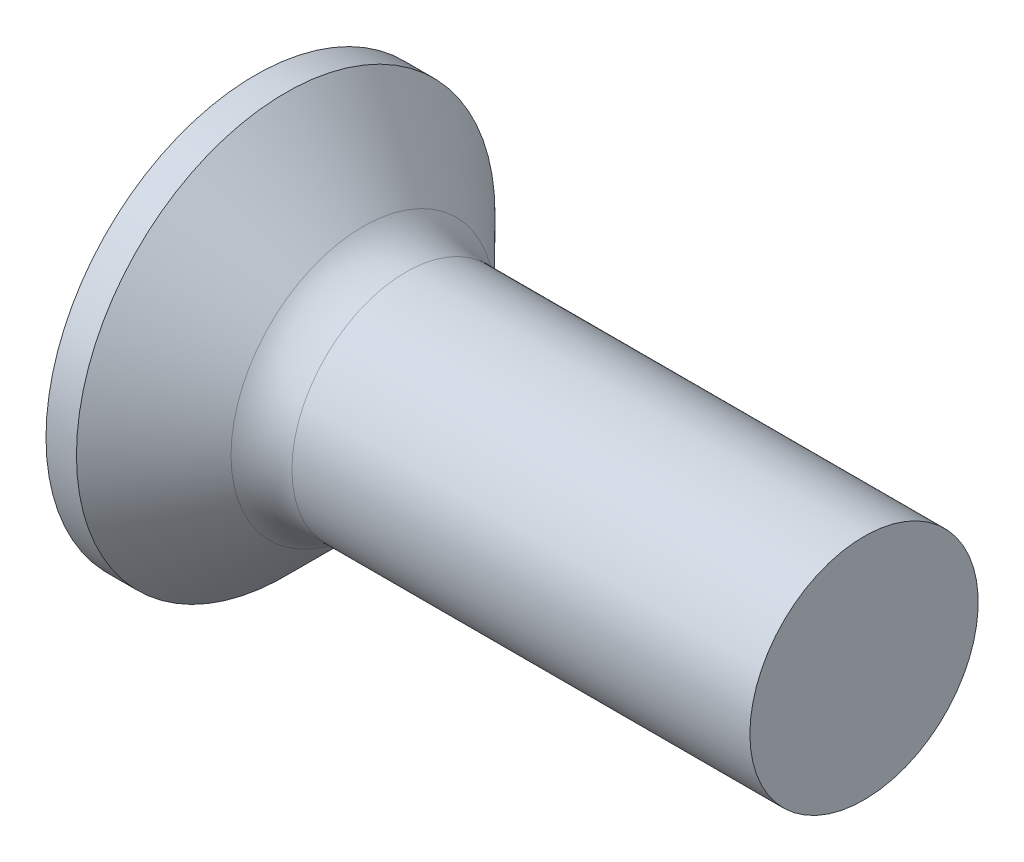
ISO-10303-21;
HEADER;
FILE_DESCRIPTION(('STEP AP214'),'2;1');
FILE_NAME('part.step','',(''),(''),'','','');
FILE_SCHEMA(('AUTOMOTIVE_DESIGN { 1 0 10303 214 1 1 1 1 }'));
ENDSEC;
DATA;
#1=APPLICATION_CONTEXT('core data for automotive mechanical design processes');
#2=APPLICATION_PROTOCOL_DEFINITION('international standard','automotive_design',2000,#1);
#3=PRODUCT_CONTEXT('',#1,'mechanical');
#4=PRODUCT('Part','Part','',(#3));
#5=PRODUCT_RELATED_PRODUCT_CATEGORY('part','',(#4));
#6=PRODUCT_DEFINITION_FORMATION('','',#4);
#7=PRODUCT_DEFINITION_CONTEXT('part definition',#1,'design');
#8=PRODUCT_DEFINITION('design','',#6,#7);
#9=PRODUCT_DEFINITION_SHAPE('','',#8);
#10=(LENGTH_UNIT() NAMED_UNIT(*) SI_UNIT(.MILLI.,.METRE.));
#11=(NAMED_UNIT(*) PLANE_ANGLE_UNIT() SI_UNIT($,.RADIAN.));
#12=(NAMED_UNIT(*) SI_UNIT($,.STERADIAN.) SOLID_ANGLE_UNIT());
#13=UNCERTAINTY_MEASURE_WITH_UNIT(LENGTH_MEASURE(1.E-05),#10,'distance_accuracy_value','');
#14=(GEOMETRIC_REPRESENTATION_CONTEXT(3) GLOBAL_UNCERTAINTY_ASSIGNED_CONTEXT((#13)) GLOBAL_UNIT_ASSIGNED_CONTEXT((#10,
#11,#12)) REPRESENTATION_CONTEXT('',''));
#15=CARTESIAN_POINT('',(0.,0.,0.));
#16=DIRECTION('',(0.,0.,1.));
#17=DIRECTION('',(1.,0.,0.));
#18=AXIS2_PLACEMENT_3D('',#15,#16,#17);
#19=CARTESIAN_POINT('',(0.,0.,0.));
#20=DIRECTION('',(-1.,0.,0.));
#21=DIRECTION('',(0.,0.,1.));
#22=AXIS2_PLACEMENT_3D('',#19,#20,#21);
#23=PLANE('',#22);
#24=CARTESIAN_POINT('',(0.,0.,0.));
#25=DIRECTION('',(-1.,0.,0.));
#26=DIRECTION('',(0.,0.,1.));
#27=AXIS2_PLACEMENT_3D('',#24,#25,#26);
#28=CIRCLE('',#27,2.75);
#29=CARTESIAN_POINT('',(0.,0.,2.75));
#30=VERTEX_POINT('',#29);
#31=EDGE_CURVE('E341',#30,#30,#28,.T.);
#32=ORIENTED_EDGE('',*,*,#31,.T.);
#33=EDGE_LOOP('',(#32));
#34=FACE_BOUND('',#33,.T.);
#35=DIRECTION('',(0.,0.,-1.));
#36=VECTOR('',#35,1.);
#37=CARTESIAN_POINT('',(0.,-0.370000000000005,1.5));
#38=LINE('',#37,#36);
#39=CARTESIAN_POINT('',(0.,-0.370000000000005,1.5));
#40=VERTEX_POINT('',#39);
#41=CARTESIAN_POINT('',(0.,-0.370000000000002,0.590157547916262));
#42=VERTEX_POINT('',#41);
#43=EDGE_CURVE('E380',#40,#42,#38,.T.);
#44=ORIENTED_EDGE('',*,*,#43,.T.);
#45=CARTESIAN_POINT('',(0.,0.,0.));
#46=DIRECTION('',(-1.,0.,0.));
#47=DIRECTION('',(0.,0.,1.));
#48=AXIS2_PLACEMENT_3D('',#45,#46,#47);
#49=CIRCLE('',#48,0.696552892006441);
#50=CARTESIAN_POINT('',(0.,-0.590157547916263,0.37));
#51=VERTEX_POINT('',#50);
#52=EDGE_CURVE('E367',#51,#42,#49,.T.);
#53=ORIENTED_EDGE('',*,*,#52,.F.);
#54=DIRECTION('',(0.,-1.,0.));
#55=VECTOR('',#54,1.);
#56=CARTESIAN_POINT('',(0.,1.5,0.37));
#57=LINE('',#56,#55);
#58=CARTESIAN_POINT('',(0.,-1.5,0.37));
#59=VERTEX_POINT('',#58);
#60=EDGE_CURVE('E427',#51,#59,#57,.T.);
#61=ORIENTED_EDGE('',*,*,#60,.T.);
#62=DIRECTION('',(0.,0.,-1.));
#63=VECTOR('',#62,1.);
#64=CARTESIAN_POINT('',(0.,-1.5,0.37));
#65=LINE('',#64,#63);
#66=CARTESIAN_POINT('',(0.,-1.5,-0.37));
#67=VERTEX_POINT('',#66);
#68=EDGE_CURVE('E338',#59,#67,#65,.T.);
#69=ORIENTED_EDGE('',*,*,#68,.T.);
#70=DIRECTION('',(0.,1.,0.));
#71=VECTOR('',#70,1.);
#72=CARTESIAN_POINT('',(0.,-1.5,-0.37));
#73=LINE('',#72,#71);
#74=CARTESIAN_POINT('',(0.,-0.590157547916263,-0.37));
#75=VERTEX_POINT('',#74);
#76=EDGE_CURVE('E428',#67,#75,#73,.T.);
#77=ORIENTED_EDGE('',*,*,#76,.T.);
#78=CARTESIAN_POINT('',(0.,-0.369999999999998,-0.590157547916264));
#79=VERTEX_POINT('',#78);
#80=EDGE_CURVE('E373',#79,#75,#49,.T.);
#81=ORIENTED_EDGE('',*,*,#80,.F.);
#82=CARTESIAN_POINT('',(0.,-0.369999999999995,-1.5));
#83=VERTEX_POINT('',#82);
#84=EDGE_CURVE('E389',#79,#83,#38,.T.);
#85=ORIENTED_EDGE('',*,*,#84,.T.);
#86=DIRECTION('',(0.,1.,0.));
#87=VECTOR('',#86,1.);
#88=CARTESIAN_POINT('',(0.,-0.369999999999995,-1.5));
#89=LINE('',#88,#87);
#90=CARTESIAN_POINT('',(0.,0.370000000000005,-1.5));
#91=VERTEX_POINT('',#90);
#92=EDGE_CURVE('E388',#83,#91,#89,.T.);
#93=ORIENTED_EDGE('',*,*,#92,.T.);
#94=DIRECTION('',(0.,0.,1.));
#95=VECTOR('',#94,1.);
#96=CARTESIAN_POINT('',(0.,0.370000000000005,-1.5));
#97=LINE('',#96,#95);
#98=CARTESIAN_POINT('',(0.,0.370000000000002,-0.590157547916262));
#99=VERTEX_POINT('',#98);
#100=EDGE_CURVE('E395',#91,#99,#97,.T.);
#101=ORIENTED_EDGE('',*,*,#100,.T.);
#102=CARTESIAN_POINT('',(0.,0.590157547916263,-0.37));
#103=VERTEX_POINT('',#102);
#104=EDGE_CURVE('E463',#103,#99,#49,.T.);
#105=ORIENTED_EDGE('',*,*,#104,.F.);
#106=CARTESIAN_POINT('',(0.,1.5,-0.37));
#107=VERTEX_POINT('',#106);
#108=EDGE_CURVE('E436',#103,#107,#73,.T.);
#109=ORIENTED_EDGE('',*,*,#108,.T.);
#110=DIRECTION('',(0.,0.,1.));
#111=VECTOR('',#110,1.);
#112=CARTESIAN_POINT('',(0.,1.5,-0.37));
#113=LINE('',#112,#111);
#114=CARTESIAN_POINT('',(0.,1.5,0.37));
#115=VERTEX_POINT('',#114);
#116=EDGE_CURVE('E424',#107,#115,#113,.T.);
#117=ORIENTED_EDGE('',*,*,#116,.T.);
#118=CARTESIAN_POINT('',(0.,0.590157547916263,0.37));
#119=VERTEX_POINT('',#118);
#120=EDGE_CURVE('E429',#115,#119,#57,.T.);
#121=ORIENTED_EDGE('',*,*,#120,.T.);
#122=CARTESIAN_POINT('',(0.,0.369999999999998,0.590157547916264));
#123=VERTEX_POINT('',#122);
#124=EDGE_CURVE('E375',#123,#119,#49,.T.);
#125=ORIENTED_EDGE('',*,*,#124,.F.);
#126=CARTESIAN_POINT('',(0.,0.369999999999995,1.5));
#127=VERTEX_POINT('',#126);
#128=EDGE_CURVE('E398',#123,#127,#97,.T.);
#129=ORIENTED_EDGE('',*,*,#128,.T.);
#130=DIRECTION('',(0.,-1.,0.));
#131=VECTOR('',#130,1.);
#132=CARTESIAN_POINT('',(0.,0.369999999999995,1.5));
#133=LINE('',#132,#131);
#134=EDGE_CURVE('E387',#127,#40,#133,.T.);
#135=ORIENTED_EDGE('',*,*,#134,.T.);
#136=EDGE_LOOP('',(#44,#53,#61,#69,#77,#81,#85,#93,#101,#105,#109,#117,#121,#125,#129,#135));
#137=FACE_BOUND('',#136,.T.);
#138=ADVANCED_FACE('F34',(#34,#137),#23,.T.);
#139=CARTESIAN_POINT('',(2.01,-0.49785100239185,0.37));
#140=DIRECTION('',(0.,0.,-1.));
#141=DIRECTION('',(0.,1.,0.));
#142=AXIS2_PLACEMENT_3D('',#139,#140,#141);
#143=PLANE('',#142);
#144=ORIENTED_EDGE('',*,*,#60,.F.);
#145=CARTESIAN_POINT('',(-1.01053649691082,-0.672102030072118,0.37));
#146=CARTESIAN_POINT('',(-0.79970605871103,-0.655267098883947,0.37));
#147=CARTESIAN_POINT('',(-0.588886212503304,-0.638297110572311,0.37));
#148=CARTESIAN_POINT('',(-0.167272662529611,-0.603984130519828,0.37));
#149=CARTESIAN_POINT('',(0.0435210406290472,-0.586641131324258,0.37));
#150=CARTESIAN_POINT('',(0.465068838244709,-0.551479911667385,0.37));
#151=CARTESIAN_POINT('',(0.67582293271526,-0.533661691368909,0.37));
#152=CARTESIAN_POINT('',(1.09727362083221,-0.497387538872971,0.37));
#153=CARTESIAN_POINT('',(1.30797021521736,-0.478931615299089,0.37));
#154=CARTESIAN_POINT('',(1.67418894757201,-0.446067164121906,0.37));
#155=CARTESIAN_POINT('',(1.82972932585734,-0.431862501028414,0.37));
#156=CARTESIAN_POINT('',(2.14074770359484,-0.40279770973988,0.37));
#157=CARTESIAN_POINT('',(2.29622570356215,-0.38793758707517,0.37));
#158=CARTESIAN_POINT('',(2.60710169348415,-0.357305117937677,0.37));
#159=CARTESIAN_POINT('',(2.76249967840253,-0.34153271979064,0.37));
#160=CARTESIAN_POINT('',(2.99549070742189,-0.316847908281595,0.37));
#161=CARTESIAN_POINT('',(3.07313791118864,-0.308448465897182,0.37));
#162=CARTESIAN_POINT('',(3.22838341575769,-0.29120225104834,0.37));
#163=CARTESIAN_POINT('',(3.30598171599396,-0.282355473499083,0.37));
#164=CARTESIAN_POINT('',(3.38354828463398,-0.273232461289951,0.37));
#165=B_SPLINE_CURVE_WITH_KNOTS('',3,(#145,#146,#147,#148,#149,#150,#151,#152,#153,#154,#155,
#156,#157,#158,#159,#160,#161,#162,#163,#164),.UNSPECIFIED.,.F.,.F.,(4,2,2,2,2,2,2,2,2,4),(0.,
0.634504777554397,1.26902224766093,1.90353950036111,2.53804817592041,3.00661008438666,
3.47516804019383,3.94375256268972,4.17805198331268,4.41235406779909),.UNSPECIFIED.);
#166=CARTESIAN_POINT('',(2.01,-0.415013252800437,0.37));
#167=VERTEX_POINT('',#166);
#168=EDGE_CURVE('E370',#51,#167,#165,.T.);
#169=ORIENTED_EDGE('',*,*,#168,.T.);
#170=DIRECTION('',(0.,-1.,0.));
#171=VECTOR('',#170,1.);
#172=CARTESIAN_POINT('',(2.01,0.497851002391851,0.37));
#173=LINE('',#172,#171);
#174=CARTESIAN_POINT('',(2.01,-0.497851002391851,0.37));
#175=VERTEX_POINT('',#174);
#176=EDGE_CURVE('E443',#167,#175,#173,.T.);
#177=ORIENTED_EDGE('',*,*,#176,.T.);
#178=DIRECTION('',(0.89493436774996,0.446197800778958,0.));
#179=VECTOR('',#178,1.);
#180=CARTESIAN_POINT('',(0.,-1.5,0.37));
#181=LINE('',#180,#179);
#182=EDGE_CURVE('E316',#59,#175,#181,.T.);
#183=ORIENTED_EDGE('',*,*,#182,.F.);
#184=EDGE_LOOP('',(#144,#169,#177,#183));
#185=FACE_BOUND('',#184,.T.);
#186=ADVANCED_FACE('F188',(#185),#143,.T.);
#187=CARTESIAN_POINT('',(2.01,0.497851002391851,0.37));
#188=VERTEX_POINT('',#187);
#189=CARTESIAN_POINT('',(2.01,0.415013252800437,0.37));
#190=VERTEX_POINT('',#189);
#191=EDGE_CURVE('E325',#188,#190,#173,.T.);
#192=ORIENTED_EDGE('',*,*,#191,.T.);
#193=CARTESIAN_POINT('',(-1.01053649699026,0.672102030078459,0.37));
#194=CARTESIAN_POINT('',(-0.799706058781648,0.65526709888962,0.37));
#195=CARTESIAN_POINT('',(-0.588886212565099,0.638297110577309,0.37));
#196=CARTESIAN_POINT('',(-0.167272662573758,0.603984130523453,0.37));
#197=CARTESIAN_POINT('',(0.043521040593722,0.586641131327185,0.37));
#198=CARTESIAN_POINT('',(0.465068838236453,0.551479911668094,0.37));
#199=CARTESIAN_POINT('',(0.675822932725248,0.533661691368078,0.37));
#200=CARTESIAN_POINT('',(1.09727362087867,0.497387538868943,0.37));
#201=CARTESIAN_POINT('',(1.30797021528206,0.478931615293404,0.37));
#202=CARTESIAN_POINT('',(1.67418894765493,0.446067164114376,0.37));
#203=CARTESIAN_POINT('',(1.82972932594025,0.431862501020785,0.37));
#204=CARTESIAN_POINT('',(2.14074770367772,0.402797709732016,0.37));
#205=CARTESIAN_POINT('',(2.29622570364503,0.38793758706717,0.37));
#206=CARTESIAN_POINT('',(2.60710169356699,0.357305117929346,0.37));
#207=CARTESIAN_POINT('',(2.76249967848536,0.341532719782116,0.37));
#208=CARTESIAN_POINT('',(2.99549070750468,0.316847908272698,0.37));
#209=CARTESIAN_POINT('',(3.07313791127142,0.308448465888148,0.37));
#210=CARTESIAN_POINT('',(3.22838341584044,0.291202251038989,0.37));
#211=CARTESIAN_POINT('',(3.30598171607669,0.282355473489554,0.37));
#212=CARTESIAN_POINT('',(3.38354828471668,0.273232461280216,0.37));
#213=B_SPLINE_CURVE_WITH_KNOTS('',3,(#193,#194,#195,#196,#197,#198,#199,#200,#201,#202,#203,
#204,#205,#206,#207,#208,#209,#210,#211,#212),.UNSPECIFIED.,.F.,.F.,(4,2,2,2,2,2,2,2,2,4),(0.,
0.634504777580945,1.26902224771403,1.90353950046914,2.53804817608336,3.00661008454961,
3.47516804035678,3.94375256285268,4.17805198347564,4.41235406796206),.UNSPECIFIED.);
#214=EDGE_CURVE('E248',#190,#119,#213,.F.);
#215=ORIENTED_EDGE('',*,*,#214,.T.);
#216=ORIENTED_EDGE('',*,*,#120,.F.);
#217=DIRECTION('',(0.89493436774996,-0.446197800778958,0.));
#218=VECTOR('',#217,1.);
#219=CARTESIAN_POINT('',(0.,1.5,0.37));
#220=LINE('',#219,#218);
#221=EDGE_CURVE('E57',#115,#188,#220,.T.);
#222=ORIENTED_EDGE('',*,*,#221,.T.);
#223=EDGE_LOOP('',(#192,#215,#216,#222));
#224=FACE_BOUND('',#223,.T.);
#225=ADVANCED_FACE('F193',(#224),#143,.T.);
#226=CARTESIAN_POINT('',(2.01,0.497851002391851,-0.37));
#227=DIRECTION('',(0.,0.,1.));
#228=DIRECTION('',(1.,0.,0.));
#229=AXIS2_PLACEMENT_3D('',#226,#227,#228);
#230=PLANE('',#229);
#231=DIRECTION('',(0.,1.,0.));
#232=VECTOR('',#231,1.);
#233=CARTESIAN_POINT('',(2.01,-0.497851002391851,-0.37));
#234=LINE('',#233,#232);
#235=CARTESIAN_POINT('',(2.01,-0.497851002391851,-0.37));
#236=VERTEX_POINT('',#235);
#237=CARTESIAN_POINT('',(2.01,-0.415013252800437,-0.37));
#238=VERTEX_POINT('',#237);
#239=EDGE_CURVE('E329',#236,#238,#234,.T.);
#240=ORIENTED_EDGE('',*,*,#239,.T.);
#241=CARTESIAN_POINT('',(-1.01053649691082,-0.672102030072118,-0.37));
#242=CARTESIAN_POINT('',(-0.79970605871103,-0.655267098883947,-0.37));
#243=CARTESIAN_POINT('',(-0.588886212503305,-0.638297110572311,-0.37));
#244=CARTESIAN_POINT('',(-0.16727266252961,-0.603984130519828,-0.37));
#245=CARTESIAN_POINT('',(0.0435210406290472,-0.586641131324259,-0.37));
#246=CARTESIAN_POINT('',(0.465068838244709,-0.551479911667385,-0.37));
#247=CARTESIAN_POINT('',(0.67582293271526,-0.533661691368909,-0.37));
#248=CARTESIAN_POINT('',(1.09727362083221,-0.497387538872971,-0.37));
#249=CARTESIAN_POINT('',(1.30797021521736,-0.47893161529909,-0.37));
#250=CARTESIAN_POINT('',(1.67418894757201,-0.446067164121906,-0.37));
#251=CARTESIAN_POINT('',(1.82972932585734,-0.431862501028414,-0.37));
#252=CARTESIAN_POINT('',(2.14074770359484,-0.40279770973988,-0.37));
#253=CARTESIAN_POINT('',(2.29622570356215,-0.38793758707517,-0.37));
#254=CARTESIAN_POINT('',(2.60710169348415,-0.357305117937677,-0.37));
#255=CARTESIAN_POINT('',(2.76249967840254,-0.34153271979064,-0.37));
#256=CARTESIAN_POINT('',(2.99549070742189,-0.316847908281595,-0.37));
#257=CARTESIAN_POINT('',(3.07313791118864,-0.308448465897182,-0.37));
#258=CARTESIAN_POINT('',(3.22838341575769,-0.29120225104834,-0.37));
#259=CARTESIAN_POINT('',(3.30598171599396,-0.282355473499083,-0.37));
#260=CARTESIAN_POINT('',(3.38354828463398,-0.273232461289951,-0.37));
#261=B_SPLINE_CURVE_WITH_KNOTS('',3,(#241,#242,#243,#244,#245,#246,#247,#248,#249,#250,#251,
#252,#253,#254,#255,#256,#257,#258,#259,#260),.UNSPECIFIED.,.F.,.F.,(4,2,2,2,2,2,2,2,2,4),(0.,
0.634504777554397,1.26902224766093,1.90353950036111,2.53804817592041,3.00661008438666,
3.47516804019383,3.94375256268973,4.17805198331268,4.41235406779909),.UNSPECIFIED.);
#262=EDGE_CURVE('E242',#238,#75,#261,.F.);
#263=ORIENTED_EDGE('',*,*,#262,.T.);
#264=ORIENTED_EDGE('',*,*,#76,.F.);
#265=DIRECTION('',(0.89493436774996,0.446197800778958,0.));
#266=VECTOR('',#265,1.);
#267=CARTESIAN_POINT('',(0.,-1.5,-0.37));
#268=LINE('',#267,#266);
#269=EDGE_CURVE('E438',#67,#236,#268,.T.);
#270=ORIENTED_EDGE('',*,*,#269,.T.);
#271=EDGE_LOOP('',(#240,#263,#264,#270));
#272=FACE_BOUND('',#271,.T.);
#273=ADVANCED_FACE('F228',(#272),#230,.T.);
#274=ORIENTED_EDGE('',*,*,#108,.F.);
#275=CARTESIAN_POINT('',(-1.01053649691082,0.672102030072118,-0.37));
#276=CARTESIAN_POINT('',(-0.79970605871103,0.655267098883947,-0.37));
#277=CARTESIAN_POINT('',(-0.588886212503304,0.638297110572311,-0.37));
#278=CARTESIAN_POINT('',(-0.16727266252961,0.603984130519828,-0.37));
#279=CARTESIAN_POINT('',(0.0435210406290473,0.586641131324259,-0.37));
#280=CARTESIAN_POINT('',(0.465068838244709,0.551479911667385,-0.37));
#281=CARTESIAN_POINT('',(0.67582293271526,0.533661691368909,-0.37));
#282=CARTESIAN_POINT('',(1.09727362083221,0.497387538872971,-0.37));
#283=CARTESIAN_POINT('',(1.30797021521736,0.478931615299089,-0.37));
#284=CARTESIAN_POINT('',(1.67418894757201,0.446067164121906,-0.37));
#285=CARTESIAN_POINT('',(1.82972932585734,0.431862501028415,-0.37));
#286=CARTESIAN_POINT('',(2.14074770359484,0.40279770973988,-0.37));
#287=CARTESIAN_POINT('',(2.29622570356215,0.38793758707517,-0.37));
#288=CARTESIAN_POINT('',(2.60710169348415,0.357305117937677,-0.37));
#289=CARTESIAN_POINT('',(2.76249967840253,0.34153271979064,-0.37));
#290=CARTESIAN_POINT('',(2.99549070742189,0.316847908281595,-0.37));
#291=CARTESIAN_POINT('',(3.07313791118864,0.308448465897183,-0.37));
#292=CARTESIAN_POINT('',(3.22838341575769,0.29120225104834,-0.37));
#293=CARTESIAN_POINT('',(3.30598171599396,0.282355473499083,-0.37));
#294=CARTESIAN_POINT('',(3.38354828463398,0.273232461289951,-0.37));
#295=B_SPLINE_CURVE_WITH_KNOTS('',3,(#275,#276,#277,#278,#279,#280,#281,#282,#283,#284,#285,
#286,#287,#288,#289,#290,#291,#292,#293,#294),.UNSPECIFIED.,.F.,.F.,(4,2,2,2,2,2,2,2,2,4),(0.,
0.634504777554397,1.26902224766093,1.90353950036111,2.53804817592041,3.00661008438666,
3.47516804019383,3.94375256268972,4.17805198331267,4.41235406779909),.UNSPECIFIED.);
#296=CARTESIAN_POINT('',(2.01,0.415013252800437,-0.37));
#297=VERTEX_POINT('',#296);
#298=EDGE_CURVE('E236',#103,#297,#295,.T.);
#299=ORIENTED_EDGE('',*,*,#298,.T.);
#300=CARTESIAN_POINT('',(2.01,0.497851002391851,-0.37));
#301=VERTEX_POINT('',#300);
#302=EDGE_CURVE('E333',#297,#301,#234,.T.);
#303=ORIENTED_EDGE('',*,*,#302,.T.);
#304=DIRECTION('',(0.89493436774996,-0.446197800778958,0.));
#305=VECTOR('',#304,1.);
#306=CARTESIAN_POINT('',(0.,1.5,-0.37));
#307=LINE('',#306,#305);
#308=EDGE_CURVE('E320',#107,#301,#307,.T.);
#309=ORIENTED_EDGE('',*,*,#308,.F.);
#310=EDGE_LOOP('',(#274,#299,#303,#309));
#311=FACE_BOUND('',#310,.T.);
#312=ADVANCED_FACE('F220',(#311),#230,.T.);
#313=CARTESIAN_POINT('',(2.01,0.497851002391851,-0.37));
#314=DIRECTION('',(1.,0.,0.));
#315=DIRECTION('',(0.,0.,-1.));
#316=AXIS2_PLACEMENT_3D('',#313,#314,#315);
#317=PLANE('',#316);
#318=CARTESIAN_POINT('',(2.01,0.,0.));
#319=DIRECTION('',(-1.,0.,0.));
#320=DIRECTION('',(0.,0.,1.));
#321=AXIS2_PLACEMENT_3D('',#318,#319,#320);
#322=CIRCLE('',#321,0.555999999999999);
#323=CARTESIAN_POINT('',(2.01,-0.247548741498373,-0.497851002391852));
#324=VERTEX_POINT('',#323);
#325=CARTESIAN_POINT('',(2.01,-0.369999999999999,-0.415013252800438));
#326=VERTEX_POINT('',#325);
#327=EDGE_CURVE('E510',#324,#326,#322,.T.);
#328=ORIENTED_EDGE('',*,*,#327,.F.);
#329=DIRECTION('',(0.,1.,0.));
#330=VECTOR('',#329,1.);
#331=CARTESIAN_POINT('',(2.01,-0.369999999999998,-0.497851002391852));
#332=LINE('',#331,#330);
#333=CARTESIAN_POINT('',(2.01,-0.369999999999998,-0.497851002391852));
#334=VERTEX_POINT('',#333);
#335=EDGE_CURVE('E410',#334,#324,#332,.T.);
#336=ORIENTED_EDGE('',*,*,#335,.F.);
#337=DIRECTION('',(0.,0.,-1.));
#338=VECTOR('',#337,1.);
#339=CARTESIAN_POINT('',(2.01,-0.370000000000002,0.497851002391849));
#340=LINE('',#339,#338);
#341=EDGE_CURVE('E414',#326,#334,#340,.T.);
#342=ORIENTED_EDGE('',*,*,#341,.F.);
#343=EDGE_LOOP('',(#328,#336,#342));
#344=FACE_BOUND('',#343,.T.);
#345=ADVANCED_FACE('F216',(#344),#317,.F.);
#346=CARTESIAN_POINT('',(2.01,-0.497851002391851,-0.247548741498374));
#347=VERTEX_POINT('',#346);
#348=EDGE_CURVE('E481',#238,#347,#322,.T.);
#349=ORIENTED_EDGE('',*,*,#348,.F.);
#350=ORIENTED_EDGE('',*,*,#239,.F.);
#351=DIRECTION('',(0.,0.,-1.));
#352=VECTOR('',#351,1.);
#353=CARTESIAN_POINT('',(2.01,-0.497851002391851,0.37));
#354=LINE('',#353,#352);
#355=EDGE_CURVE('E321',#347,#236,#354,.T.);
#356=ORIENTED_EDGE('',*,*,#355,.F.);
#357=EDGE_LOOP('',(#349,#350,#356));
#358=FACE_BOUND('',#357,.T.);
#359=ADVANCED_FACE('F219',(#358),#317,.F.);
#360=CARTESIAN_POINT('',(2.01,-0.497851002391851,0.247548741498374));
#361=VERTEX_POINT('',#360);
#362=EDGE_CURVE('E477',#361,#167,#322,.T.);
#363=ORIENTED_EDGE('',*,*,#362,.F.);
#364=EDGE_CURVE('E311',#175,#361,#354,.T.);
#365=ORIENTED_EDGE('',*,*,#364,.F.);
#366=ORIENTED_EDGE('',*,*,#176,.F.);
#367=EDGE_LOOP('',(#363,#365,#366));
#368=FACE_BOUND('',#367,.T.);
#369=ADVANCED_FACE('F475',(#368),#317,.F.);
#370=CARTESIAN_POINT('',(2.01,-0.370000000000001,0.415013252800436));
#371=VERTEX_POINT('',#370);
#372=CARTESIAN_POINT('',(2.01,-0.247548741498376,0.49785100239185));
#373=VERTEX_POINT('',#372);
#374=EDGE_CURVE('E49',#371,#373,#322,.T.);
#375=ORIENTED_EDGE('',*,*,#374,.F.);
#376=CARTESIAN_POINT('',(2.01,-0.370000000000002,0.497851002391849));
#377=VERTEX_POINT('',#376);
#378=EDGE_CURVE('E383',#377,#371,#340,.T.);
#379=ORIENTED_EDGE('',*,*,#378,.F.);
#380=DIRECTION('',(0.,-1.,0.));
#381=VECTOR('',#380,1.);
#382=CARTESIAN_POINT('',(2.01,0.369999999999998,0.497851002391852));
#383=LINE('',#382,#381);
#384=EDGE_CURVE('E415',#373,#377,#383,.T.);
#385=ORIENTED_EDGE('',*,*,#384,.F.);
#386=EDGE_LOOP('',(#375,#379,#385));
#387=FACE_BOUND('',#386,.T.);
#388=ADVANCED_FACE('F521',(#387),#317,.F.);
#389=CARTESIAN_POINT('',(2.01,0.247548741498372,0.497851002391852));
#390=VERTEX_POINT('',#389);
#391=CARTESIAN_POINT('',(2.01,0.369999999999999,0.415013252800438));
#392=VERTEX_POINT('',#391);
#393=EDGE_CURVE('E374',#390,#392,#322,.T.);
#394=ORIENTED_EDGE('',*,*,#393,.F.);
#395=CARTESIAN_POINT('',(2.01,0.369999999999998,0.497851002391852));
#396=VERTEX_POINT('',#395);
#397=EDGE_CURVE('E411',#396,#390,#383,.T.);
#398=ORIENTED_EDGE('',*,*,#397,.F.);
#399=DIRECTION('',(0.,0.,1.));
#400=VECTOR('',#399,1.);
#401=CARTESIAN_POINT('',(2.01,0.370000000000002,-0.49785100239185));
#402=LINE('',#401,#400);
#403=EDGE_CURVE('E423',#392,#396,#402,.T.);
#404=ORIENTED_EDGE('',*,*,#403,.F.);
#405=EDGE_LOOP('',(#394,#398,#404));
#406=FACE_BOUND('',#405,.T.);
#407=ADVANCED_FACE('F486',(#406),#317,.F.);
#408=CARTESIAN_POINT('',(2.01,0.497851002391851,0.247548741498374));
#409=VERTEX_POINT('',#408);
#410=EDGE_CURVE('E455',#190,#409,#322,.T.);
#411=ORIENTED_EDGE('',*,*,#410,.F.);
#412=ORIENTED_EDGE('',*,*,#191,.F.);
#413=DIRECTION('',(0.,0.,1.));
#414=VECTOR('',#413,1.);
#415=CARTESIAN_POINT('',(2.01,0.497851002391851,-0.37));
#416=LINE('',#415,#414);
#417=EDGE_CURVE('E332',#409,#188,#416,.T.);
#418=ORIENTED_EDGE('',*,*,#417,.F.);
#419=EDGE_LOOP('',(#411,#412,#418));
#420=FACE_BOUND('',#419,.T.);
#421=ADVANCED_FACE('F453',(#420),#317,.F.);
#422=CARTESIAN_POINT('',(2.01,0.497851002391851,-0.247548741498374));
#423=VERTEX_POINT('',#422);
#424=EDGE_CURVE('E461',#423,#297,#322,.T.);
#425=ORIENTED_EDGE('',*,*,#424,.F.);
#426=EDGE_CURVE('E441',#301,#423,#416,.T.);
#427=ORIENTED_EDGE('',*,*,#426,.F.);
#428=ORIENTED_EDGE('',*,*,#302,.F.);
#429=EDGE_LOOP('',(#425,#427,#428));
#430=FACE_BOUND('',#429,.T.);
#431=ADVANCED_FACE('F305',(#430),#317,.F.);
#432=CARTESIAN_POINT('',(2.01,0.370000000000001,-0.415013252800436));
#433=VERTEX_POINT('',#432);
#434=CARTESIAN_POINT('',(2.01,0.247548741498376,-0.49785100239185));
#435=VERTEX_POINT('',#434);
#436=EDGE_CURVE('E504',#433,#435,#322,.T.);
#437=ORIENTED_EDGE('',*,*,#436,.F.);
#438=CARTESIAN_POINT('',(2.01,0.370000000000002,-0.49785100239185));
#439=VERTEX_POINT('',#438);
#440=EDGE_CURVE('E420',#439,#433,#402,.T.);
#441=ORIENTED_EDGE('',*,*,#440,.F.);
#442=EDGE_CURVE('E417',#435,#439,#332,.T.);
#443=ORIENTED_EDGE('',*,*,#442,.F.);
#444=EDGE_LOOP('',(#437,#441,#443));
#445=FACE_BOUND('',#444,.T.);
#446=ADVANCED_FACE('F222',(#445),#317,.F.);
#447=CARTESIAN_POINT('',(2.01,-0.497851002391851,-0.37));
#448=DIRECTION('',(-0.446197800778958,0.89493436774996,0.));
#449=DIRECTION('',(-0.89493436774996,-0.446197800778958,0.));
#450=AXIS2_PLACEMENT_3D('',#447,#448,#449);
#451=PLANE('',#450);
#452=ORIENTED_EDGE('',*,*,#364,.T.);
#453=CARTESIAN_POINT('',(2.86902882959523,-0.0695550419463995,0.));
#454=DIRECTION('',(-0.446197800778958,0.89493436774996,0.));
#455=DIRECTION('',(-0.89493436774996,-0.446197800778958,0.));
#456=AXIS2_PLACEMENT_3D('',#453,#454,#455);
#457=ELLIPSE('',#456,1.11145965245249,0.491029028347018);
#458=EDGE_CURVE('E312',#361,#347,#457,.F.);
#459=ORIENTED_EDGE('',*,*,#458,.T.);
#460=ORIENTED_EDGE('',*,*,#355,.T.);
#461=ORIENTED_EDGE('',*,*,#269,.F.);
#462=ORIENTED_EDGE('',*,*,#68,.F.);
#463=ORIENTED_EDGE('',*,*,#182,.T.);
#464=EDGE_LOOP('',(#452,#459,#460,#461,#462,#463));
#465=FACE_BOUND('',#464,.T.);
#466=ADVANCED_FACE('F227',(#465),#451,.T.);
#467=CARTESIAN_POINT('',(2.01,0.497851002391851,0.37));
#468=DIRECTION('',(-0.446197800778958,-0.89493436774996,0.));
#469=DIRECTION('',(0.89493436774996,-0.446197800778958,0.));
#470=AXIS2_PLACEMENT_3D('',#467,#468,#469);
#471=PLANE('',#470);
#472=ORIENTED_EDGE('',*,*,#426,.T.);
#473=CARTESIAN_POINT('',(2.86902882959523,0.0695550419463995,0.));
#474=DIRECTION('',(-0.446197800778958,-0.89493436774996,0.));
#475=DIRECTION('',(-0.89493436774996,0.446197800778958,0.));
#476=AXIS2_PLACEMENT_3D('',#473,#474,#475);
#477=ELLIPSE('',#476,1.11145965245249,0.491029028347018);
#478=EDGE_CURVE('E289',#423,#409,#477,.F.);
#479=ORIENTED_EDGE('',*,*,#478,.T.);
#480=ORIENTED_EDGE('',*,*,#417,.T.);
#481=ORIENTED_EDGE('',*,*,#221,.F.);
#482=ORIENTED_EDGE('',*,*,#116,.F.);
#483=ORIENTED_EDGE('',*,*,#308,.T.);
#484=EDGE_LOOP('',(#472,#479,#480,#481,#482,#483));
#485=FACE_BOUND('',#484,.T.);
#486=ADVANCED_FACE('F223',(#485),#471,.T.);
#487=CARTESIAN_POINT('',(2.01,0.369999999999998,0.497851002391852));
#488=DIRECTION('',(0.,-1.,0.));
#489=DIRECTION('',(1.,0.,0.));
#490=AXIS2_PLACEMENT_3D('',#487,#488,#489);
#491=PLANE('',#490);
#492=ORIENTED_EDGE('',*,*,#440,.T.);
#493=CARTESIAN_POINT('',(-1.01053649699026,0.370000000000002,-0.672102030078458));
#494=CARTESIAN_POINT('',(-0.799706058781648,0.370000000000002,-0.655267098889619));
#495=CARTESIAN_POINT('',(-0.588886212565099,0.370000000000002,-0.638297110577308));
#496=CARTESIAN_POINT('',(-0.167272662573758,0.370000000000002,-0.603984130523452));
#497=CARTESIAN_POINT('',(0.0435210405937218,0.370000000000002,-0.586641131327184));
#498=CARTESIAN_POINT('',(0.465068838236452,0.370000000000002,-0.551479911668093));
#499=CARTESIAN_POINT('',(0.675822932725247,0.370000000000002,-0.533661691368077));
#500=CARTESIAN_POINT('',(1.09727362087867,0.370000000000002,-0.497387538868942));
#501=CARTESIAN_POINT('',(1.30797021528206,0.370000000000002,-0.478931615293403));
#502=CARTESIAN_POINT('',(1.67418894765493,0.370000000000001,-0.446067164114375));
#503=CARTESIAN_POINT('',(1.82972932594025,0.370000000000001,-0.431862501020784));
#504=CARTESIAN_POINT('',(2.14074770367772,0.370000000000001,-0.402797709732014));
#505=CARTESIAN_POINT('',(2.29622570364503,0.370000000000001,-0.387937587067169));
#506=CARTESIAN_POINT('',(2.60710169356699,0.370000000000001,-0.357305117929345));
#507=CARTESIAN_POINT('',(2.76249967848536,0.370000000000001,-0.341532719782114));
#508=CARTESIAN_POINT('',(2.99549070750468,0.370000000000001,-0.316847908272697));
#509=CARTESIAN_POINT('',(3.07313791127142,0.370000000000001,-0.308448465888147));
#510=CARTESIAN_POINT('',(3.22838341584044,0.370000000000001,-0.291202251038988));
#511=CARTESIAN_POINT('',(3.30598171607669,0.370000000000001,-0.282355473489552));
#512=CARTESIAN_POINT('',(3.38354828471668,0.370000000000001,-0.273232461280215));
#513=B_SPLINE_CURVE_WITH_KNOTS('',3,(#493,#494,#495,#496,#497,#498,#499,#500,#501,#502,#503,
#504,#505,#506,#507,#508,#509,#510,#511,#512),.UNSPECIFIED.,.F.,.F.,(4,2,2,2,2,2,2,2,2,4),(0.,
0.634504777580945,1.26902224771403,1.90353950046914,2.53804817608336,3.00661008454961,
3.47516804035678,3.94375256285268,4.17805198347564,4.41235406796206),.UNSPECIFIED.);
#514=EDGE_CURVE('E282',#433,#99,#513,.F.);
#515=ORIENTED_EDGE('',*,*,#514,.T.);
#516=ORIENTED_EDGE('',*,*,#100,.F.);
#517=DIRECTION('',(0.89493436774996,0.,0.446197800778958));
#518=VECTOR('',#517,1.);
#519=CARTESIAN_POINT('',(0.,0.370000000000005,-1.5));
#520=LINE('',#519,#518);
#521=EDGE_CURVE('E402',#91,#439,#520,.T.);
#522=ORIENTED_EDGE('',*,*,#521,.T.);
#523=EDGE_LOOP('',(#492,#515,#516,#522));
#524=FACE_BOUND('',#523,.T.);
#525=ADVANCED_FACE('F226',(#524),#491,.T.);
#526=CARTESIAN_POINT('',(2.01,-0.369999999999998,-0.497851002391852));
#527=DIRECTION('',(0.,1.,0.));
#528=DIRECTION('',(0.,0.,1.));
#529=AXIS2_PLACEMENT_3D('',#526,#527,#528);
#530=PLANE('',#529);
#531=ORIENTED_EDGE('',*,*,#84,.F.);
#532=CARTESIAN_POINT('',(-1.01053649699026,-0.369999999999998,-0.67210203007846));
#533=CARTESIAN_POINT('',(-0.799706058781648,-0.369999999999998,-0.655267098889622));
#534=CARTESIAN_POINT('',(-0.588886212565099,-0.369999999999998,-0.638297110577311));
#535=CARTESIAN_POINT('',(-0.167272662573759,-0.369999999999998,-0.603984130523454));
#536=CARTESIAN_POINT('',(0.0435210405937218,-0.369999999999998,-0.586641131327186));
#537=CARTESIAN_POINT('',(0.465068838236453,-0.369999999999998,-0.551479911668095));
#538=CARTESIAN_POINT('',(0.675822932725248,-0.369999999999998,-0.53366169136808));
#539=CARTESIAN_POINT('',(1.09727362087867,-0.369999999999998,-0.497387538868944));
#540=CARTESIAN_POINT('',(1.30797021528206,-0.369999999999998,-0.478931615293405));
#541=CARTESIAN_POINT('',(1.67418894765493,-0.369999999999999,-0.446067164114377));
#542=CARTESIAN_POINT('',(1.82972932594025,-0.369999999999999,-0.431862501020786));
#543=CARTESIAN_POINT('',(2.14074770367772,-0.369999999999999,-0.402797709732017));
#544=CARTESIAN_POINT('',(2.29622570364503,-0.369999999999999,-0.387937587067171));
#545=CARTESIAN_POINT('',(2.60710169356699,-0.369999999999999,-0.357305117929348));
#546=CARTESIAN_POINT('',(2.76249967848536,-0.369999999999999,-0.341532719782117));
#547=CARTESIAN_POINT('',(2.99549070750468,-0.369999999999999,-0.316847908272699));
#548=CARTESIAN_POINT('',(3.07313791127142,-0.369999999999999,-0.30844846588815));
#549=CARTESIAN_POINT('',(3.22838341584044,-0.369999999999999,-0.291202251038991));
#550=CARTESIAN_POINT('',(3.30598171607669,-0.369999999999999,-0.282355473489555));
#551=CARTESIAN_POINT('',(3.38354828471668,-0.369999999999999,-0.273232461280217));
#552=B_SPLINE_CURVE_WITH_KNOTS('',3,(#532,#533,#534,#535,#536,#537,#538,#539,#540,#541,#542,
#543,#544,#545,#546,#547,#548,#549,#550,#551),.UNSPECIFIED.,.F.,.F.,(4,2,2,2,2,2,2,2,2,4),(0.,
0.634504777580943,1.26902224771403,1.90353950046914,2.53804817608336,3.00661008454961,
3.47516804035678,3.94375256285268,4.17805198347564,4.41235406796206),.UNSPECIFIED.);
#553=EDGE_CURVE('E276',#79,#326,#552,.T.);
#554=ORIENTED_EDGE('',*,*,#553,.T.);
#555=ORIENTED_EDGE('',*,*,#341,.T.);
#556=DIRECTION('',(0.89493436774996,0.,0.446197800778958));
#557=VECTOR('',#556,1.);
#558=CARTESIAN_POINT('',(0.,-0.369999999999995,-1.5));
#559=LINE('',#558,#557);
#560=EDGE_CURVE('E399',#83,#334,#559,.T.);
#561=ORIENTED_EDGE('',*,*,#560,.F.);
#562=EDGE_LOOP('',(#531,#554,#555,#561));
#563=FACE_BOUND('',#562,.T.);
#564=ADVANCED_FACE('F293',(#563),#530,.T.);
#565=CARTESIAN_POINT('',(2.01,0.370000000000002,-0.49785100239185));
#566=DIRECTION('',(-0.446197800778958,0.,0.89493436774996));
#567=DIRECTION('',(-0.89493436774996,0.,-0.446197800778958));
#568=AXIS2_PLACEMENT_3D('',#565,#566,#567);
#569=PLANE('',#568);
#570=ORIENTED_EDGE('',*,*,#335,.T.);
#571=CARTESIAN_POINT('',(2.86902882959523,0.,-0.0695550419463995));
#572=DIRECTION('',(-0.446197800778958,0.,0.89493436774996));
#573=DIRECTION('',(-0.89493436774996,0.,-0.446197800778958));
#574=AXIS2_PLACEMENT_3D('',#571,#572,#573);
#575=ELLIPSE('',#574,1.11145965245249,0.491029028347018);
#576=EDGE_CURVE('E384',#324,#435,#575,.F.);
#577=ORIENTED_EDGE('',*,*,#576,.T.);
#578=ORIENTED_EDGE('',*,*,#442,.T.);
#579=ORIENTED_EDGE('',*,*,#521,.F.);
#580=ORIENTED_EDGE('',*,*,#92,.F.);
#581=ORIENTED_EDGE('',*,*,#560,.T.);
#582=EDGE_LOOP('',(#570,#577,#578,#579,#580,#581));
#583=FACE_BOUND('',#582,.T.);
#584=ADVANCED_FACE('F255',(#583),#569,.T.);
#585=ORIENTED_EDGE('',*,*,#378,.T.);
#586=CARTESIAN_POINT('',(-1.01053649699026,-0.370000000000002,0.672102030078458));
#587=CARTESIAN_POINT('',(-0.799706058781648,-0.370000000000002,0.655267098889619));
#588=CARTESIAN_POINT('',(-0.588886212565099,-0.370000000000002,0.638297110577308));
#589=CARTESIAN_POINT('',(-0.167272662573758,-0.370000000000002,0.603984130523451));
#590=CARTESIAN_POINT('',(0.0435210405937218,-0.370000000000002,0.586641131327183));
#591=CARTESIAN_POINT('',(0.465068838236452,-0.370000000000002,0.551479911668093));
#592=CARTESIAN_POINT('',(0.675822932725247,-0.370000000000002,0.533661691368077));
#593=CARTESIAN_POINT('',(1.09727362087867,-0.370000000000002,0.497387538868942));
#594=CARTESIAN_POINT('',(1.30797021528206,-0.370000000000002,0.478931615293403));
#595=CARTESIAN_POINT('',(1.67418894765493,-0.370000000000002,0.446067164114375));
#596=CARTESIAN_POINT('',(1.82972932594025,-0.370000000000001,0.431862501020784));
#597=CARTESIAN_POINT('',(2.14074770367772,-0.370000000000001,0.402797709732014));
#598=CARTESIAN_POINT('',(2.29622570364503,-0.370000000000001,0.387937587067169));
#599=CARTESIAN_POINT('',(2.60710169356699,-0.370000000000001,0.357305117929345));
#600=CARTESIAN_POINT('',(2.76249967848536,-0.370000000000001,0.341532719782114));
#601=CARTESIAN_POINT('',(2.99549070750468,-0.370000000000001,0.316847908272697));
#602=CARTESIAN_POINT('',(3.07313791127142,-0.370000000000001,0.308448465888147));
#603=CARTESIAN_POINT('',(3.22838341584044,-0.370000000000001,0.291202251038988));
#604=CARTESIAN_POINT('',(3.30598171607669,-0.370000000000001,0.282355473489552));
#605=CARTESIAN_POINT('',(3.38354828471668,-0.370000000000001,0.273232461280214));
#606=B_SPLINE_CURVE_WITH_KNOTS('',3,(#586,#587,#588,#589,#590,#591,#592,#593,#594,#595,#596,
#597,#598,#599,#600,#601,#602,#603,#604,#605),.UNSPECIFIED.,.F.,.F.,(4,2,2,2,2,2,2,2,2,4),(0.,
0.634504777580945,1.26902224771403,1.90353950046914,2.53804817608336,3.00661008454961,
3.47516804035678,3.94375256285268,4.17805198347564,4.41235406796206),.UNSPECIFIED.);
#607=EDGE_CURVE('E269',#371,#42,#606,.F.);
#608=ORIENTED_EDGE('',*,*,#607,.T.);
#609=ORIENTED_EDGE('',*,*,#43,.F.);
#610=DIRECTION('',(0.89493436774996,0.,-0.446197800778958));
#611=VECTOR('',#610,1.);
#612=CARTESIAN_POINT('',(0.,-0.370000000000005,1.5));
#613=LINE('',#612,#611);
#614=EDGE_CURVE('E405',#40,#377,#613,.T.);
#615=ORIENTED_EDGE('',*,*,#614,.T.);
#616=EDGE_LOOP('',(#585,#608,#609,#615));
#617=FACE_BOUND('',#616,.T.);
#618=ADVANCED_FACE('F378',(#617),#530,.T.);
#619=ORIENTED_EDGE('',*,*,#128,.F.);
#620=CARTESIAN_POINT('',(-1.01053649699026,0.369999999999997,0.67210203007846));
#621=CARTESIAN_POINT('',(-0.799706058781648,0.369999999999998,0.655267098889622));
#622=CARTESIAN_POINT('',(-0.588886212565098,0.369999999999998,0.638297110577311));
#623=CARTESIAN_POINT('',(-0.167272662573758,0.369999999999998,0.603984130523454));
#624=CARTESIAN_POINT('',(0.0435210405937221,0.369999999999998,0.586641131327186));
#625=CARTESIAN_POINT('',(0.465068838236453,0.369999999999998,0.551479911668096));
#626=CARTESIAN_POINT('',(0.675822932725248,0.369999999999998,0.53366169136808));
#627=CARTESIAN_POINT('',(1.09727362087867,0.369999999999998,0.497387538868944));
#628=CARTESIAN_POINT('',(1.30797021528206,0.369999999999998,0.478931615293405));
#629=CARTESIAN_POINT('',(1.67418894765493,0.369999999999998,0.446067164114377));
#630=CARTESIAN_POINT('',(1.82972932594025,0.369999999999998,0.431862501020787));
#631=CARTESIAN_POINT('',(2.14074770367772,0.369999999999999,0.402797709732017));
#632=CARTESIAN_POINT('',(2.29622570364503,0.369999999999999,0.387937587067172));
#633=CARTESIAN_POINT('',(2.60710169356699,0.369999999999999,0.357305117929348));
#634=CARTESIAN_POINT('',(2.76249967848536,0.369999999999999,0.341532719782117));
#635=CARTESIAN_POINT('',(2.99549070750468,0.369999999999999,0.3168479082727));
#636=CARTESIAN_POINT('',(3.07313791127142,0.369999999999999,0.30844846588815));
#637=CARTESIAN_POINT('',(3.22838341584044,0.369999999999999,0.291202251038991));
#638=CARTESIAN_POINT('',(3.30598171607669,0.369999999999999,0.282355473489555));
#639=CARTESIAN_POINT('',(3.38354828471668,0.369999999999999,0.273232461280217));
#640=B_SPLINE_CURVE_WITH_KNOTS('',3,(#620,#621,#622,#623,#624,#625,#626,#627,#628,#629,#630,
#631,#632,#633,#634,#635,#636,#637,#638,#639),.UNSPECIFIED.,.F.,.F.,(4,2,2,2,2,2,2,2,2,4),(0.,
0.634504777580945,1.26902224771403,1.90353950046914,2.53804817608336,3.00661008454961,
3.47516804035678,3.94375256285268,4.17805198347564,4.41235406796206),.UNSPECIFIED.);
#641=EDGE_CURVE('E260',#123,#392,#640,.T.);
#642=ORIENTED_EDGE('',*,*,#641,.T.);
#643=ORIENTED_EDGE('',*,*,#403,.T.);
#644=DIRECTION('',(0.89493436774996,0.,-0.446197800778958));
#645=VECTOR('',#644,1.);
#646=CARTESIAN_POINT('',(0.,0.369999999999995,1.5));
#647=LINE('',#646,#645);
#648=EDGE_CURVE('E407',#127,#396,#647,.T.);
#649=ORIENTED_EDGE('',*,*,#648,.F.);
#650=EDGE_LOOP('',(#619,#642,#643,#649));
#651=FACE_BOUND('',#650,.T.);
#652=ADVANCED_FACE('F295',(#651),#491,.T.);
#653=CARTESIAN_POINT('',(2.01,-0.370000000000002,0.497851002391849));
#654=DIRECTION('',(-0.446197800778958,0.,-0.89493436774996));
#655=DIRECTION('',(0.89493436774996,0.,-0.446197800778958));
#656=AXIS2_PLACEMENT_3D('',#653,#654,#655);
#657=PLANE('',#656);
#658=ORIENTED_EDGE('',*,*,#397,.T.);
#659=CARTESIAN_POINT('',(2.86902882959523,0.,0.0695550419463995));
#660=DIRECTION('',(-0.446197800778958,0.,-0.89493436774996));
#661=DIRECTION('',(-0.89493436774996,0.,0.446197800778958));
#662=AXIS2_PLACEMENT_3D('',#659,#660,#661);
#663=ELLIPSE('',#662,1.11145965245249,0.491029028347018);
#664=EDGE_CURVE('E11',#390,#373,#663,.F.);
#665=ORIENTED_EDGE('',*,*,#664,.T.);
#666=ORIENTED_EDGE('',*,*,#384,.T.);
#667=ORIENTED_EDGE('',*,*,#614,.F.);
#668=ORIENTED_EDGE('',*,*,#134,.F.);
#669=ORIENTED_EDGE('',*,*,#648,.T.);
#670=EDGE_LOOP('',(#658,#665,#666,#667,#668,#669));
#671=FACE_BOUND('',#670,.T.);
#672=ADVANCED_FACE('F203',(#671),#657,.T.);
#673=CARTESIAN_POINT('',(-6.34999999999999,0.,0.));
#674=DIRECTION('',(-1.,0.,0.));
#675=DIRECTION('',(0.,0.,1.));
#676=AXIS2_PLACEMENT_3D('',#673,#674,#675);
#677=CYLINDRICAL_SURFACE('',#676,2.75);
#678=CARTESIAN_POINT('',(0.400000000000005,0.,0.));
#679=DIRECTION('',(-1.,0.,0.));
#680=DIRECTION('',(0.,0.,1.));
#681=AXIS2_PLACEMENT_3D('',#678,#679,#680);
#682=CIRCLE('',#681,2.75);
#683=CARTESIAN_POINT('',(0.400000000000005,0.,2.75));
#684=VERTEX_POINT('',#683);
#685=EDGE_CURVE('E337',#684,#684,#682,.T.);
#686=ORIENTED_EDGE('',*,*,#685,.T.);
#687=EDGE_LOOP('',(#686));
#688=FACE_BOUND('',#687,.T.);
#689=ORIENTED_EDGE('',*,*,#31,.F.);
#690=EDGE_LOOP('',(#689));
#691=FACE_BOUND('',#690,.T.);
#692=ADVANCED_FACE('F199',(#688,#691),#677,.T.);
#693=CARTESIAN_POINT('',(0.400000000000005,0.,0.));
#694=DIRECTION('',(-1.,0.,0.));
#695=DIRECTION('',(0.,0.,1.));
#696=AXIS2_PLACEMENT_3D('',#693,#694,#695);
#697=CONICAL_SURFACE('',#696,2.75,0.78539816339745);
#698=CARTESIAN_POINT('',(1.41568542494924,0.,0.));
#699=DIRECTION('',(-1.,0.,0.));
#700=DIRECTION('',(0.,0.,1.));
#701=AXIS2_PLACEMENT_3D('',#698,#699,#700);
#702=CIRCLE('',#701,1.73431457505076);
#703=CARTESIAN_POINT('',(1.41568542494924,0.,1.73431457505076));
#704=VERTEX_POINT('',#703);
#705=EDGE_CURVE('E343',#704,#704,#702,.T.);
#706=ORIENTED_EDGE('',*,*,#705,.T.);
#707=EDGE_LOOP('',(#706));
#708=FACE_BOUND('',#707,.T.);
#709=ORIENTED_EDGE('',*,*,#685,.F.);
#710=EDGE_LOOP('',(#709));
#711=FACE_BOUND('',#710,.T.);
#712=ADVANCED_FACE('F202',(#708,#711),#697,.T.);
#713=CARTESIAN_POINT('',(-6.34999999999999,0.,0.));
#714=DIRECTION('',(-1.,0.,0.));
#715=DIRECTION('',(0.,0.,1.));
#716=AXIS2_PLACEMENT_3D('',#713,#714,#715);
#717=CYLINDRICAL_SURFACE('',#716,1.5);
#718=CARTESIAN_POINT('',(1.98137084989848,0.,0.));
#719=DIRECTION('',(-1.,0.,0.));
#720=DIRECTION('',(0.,0.,1.));
#721=AXIS2_PLACEMENT_3D('',#718,#719,#720);
#722=CIRCLE('',#721,1.5);
#723=CARTESIAN_POINT('',(1.98137084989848,0.,1.5));
#724=VERTEX_POINT('',#723);
#725=EDGE_CURVE('E42',#724,#724,#722,.F.);
#726=ORIENTED_EDGE('',*,*,#725,.T.);
#727=EDGE_LOOP('',(#726));
#728=FACE_BOUND('',#727,.T.);
#729=CARTESIAN_POINT('',(8.,0.,0.));
#730=DIRECTION('',(-1.,0.,0.));
#731=DIRECTION('',(0.,0.,1.));
#732=AXIS2_PLACEMENT_3D('',#729,#730,#731);
#733=CIRCLE('',#732,1.5);
#734=CARTESIAN_POINT('',(8.,0.,1.5));
#735=VERTEX_POINT('',#734);
#736=EDGE_CURVE('E334',#735,#735,#733,.T.);
#737=ORIENTED_EDGE('',*,*,#736,.T.);
#738=EDGE_LOOP('',(#737));
#739=FACE_BOUND('',#738,.T.);
#740=ADVANCED_FACE('F207',(#728,#739),#717,.T.);
#741=CARTESIAN_POINT('',(8.,1.5,0.));
#742=DIRECTION('',(1.,0.,0.));
#743=DIRECTION('',(0.,0.,-1.));
#744=AXIS2_PLACEMENT_3D('',#741,#742,#743);
#745=PLANE('',#744);
#746=ORIENTED_EDGE('',*,*,#736,.F.);
#747=EDGE_LOOP('',(#746));
#748=FACE_BOUND('',#747,.T.);
#749=ADVANCED_FACE('F211',(#748),#745,.T.);
#750=CARTESIAN_POINT('',(1.98137084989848,0.,0.));
#751=DIRECTION('',(-1.,0.,0.));
#752=DIRECTION('',(0.,0.,1.));
#753=AXIS2_PLACEMENT_3D('',#750,#751,#752);
#754=TOROIDAL_SURFACE('',#753,2.3,0.8);
#755=ORIENTED_EDGE('',*,*,#725,.F.);
#756=EDGE_LOOP('',(#755));
#757=FACE_BOUND('',#756,.T.);
#758=ORIENTED_EDGE('',*,*,#705,.F.);
#759=EDGE_LOOP('',(#758));
#760=FACE_BOUND('',#759,.T.);
#761=ADVANCED_FACE('F36',(#757,#760),#754,.F.);
#762=CARTESIAN_POINT('',(2.01,0.,0.));
#763=DIRECTION('',(-1.,0.,0.));
#764=DIRECTION('',(0.,0.,1.));
#765=AXIS2_PLACEMENT_3D('',#762,#763,#764);
#766=CONICAL_SURFACE('',#765,0.555999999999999,0.0698131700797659);
#767=ORIENTED_EDGE('',*,*,#52,.T.);
#768=ORIENTED_EDGE('',*,*,#607,.F.);
#769=EDGE_CURVE('E480',#167,#371,#322,.T.);
#770=ORIENTED_EDGE('',*,*,#769,.F.);
#771=ORIENTED_EDGE('',*,*,#168,.F.);
#772=EDGE_LOOP('',(#767,#768,#770,#771));
#773=FACE_BOUND('',#772,.T.);
#774=ADVANCED_FACE('F185',(#773),#766,.F.);
#775=EDGE_CURVE('E458',#392,#190,#322,.T.);
#776=ORIENTED_EDGE('',*,*,#775,.F.);
#777=ORIENTED_EDGE('',*,*,#641,.F.);
#778=ORIENTED_EDGE('',*,*,#124,.T.);
#779=ORIENTED_EDGE('',*,*,#214,.F.);
#780=EDGE_LOOP('',(#776,#777,#778,#779));
#781=FACE_BOUND('',#780,.T.);
#782=ADVANCED_FACE('F359',(#781),#766,.F.);
#783=EDGE_CURVE('E513',#326,#238,#322,.T.);
#784=ORIENTED_EDGE('',*,*,#783,.F.);
#785=ORIENTED_EDGE('',*,*,#553,.F.);
#786=ORIENTED_EDGE('',*,*,#80,.T.);
#787=ORIENTED_EDGE('',*,*,#262,.F.);
#788=EDGE_LOOP('',(#784,#785,#786,#787));
#789=FACE_BOUND('',#788,.T.);
#790=ADVANCED_FACE('F364',(#789),#766,.F.);
#791=ORIENTED_EDGE('',*,*,#104,.T.);
#792=ORIENTED_EDGE('',*,*,#514,.F.);
#793=EDGE_CURVE('E503',#297,#433,#322,.T.);
#794=ORIENTED_EDGE('',*,*,#793,.F.);
#795=ORIENTED_EDGE('',*,*,#298,.F.);
#796=EDGE_LOOP('',(#791,#792,#794,#795));
#797=FACE_BOUND('',#796,.T.);
#798=ADVANCED_FACE('F616',(#797),#766,.F.);
#799=EDGE_CURVE('E459',#409,#423,#322,.T.);
#800=ORIENTED_EDGE('',*,*,#799,.F.);
#801=ORIENTED_EDGE('',*,*,#478,.F.);
#802=EDGE_LOOP('',(#800,#801));
#803=FACE_BOUND('',#802,.T.);
#804=ADVANCED_FACE('F624',(#803),#766,.F.);
#805=EDGE_CURVE('E479',#347,#361,#322,.T.);
#806=ORIENTED_EDGE('',*,*,#805,.F.);
#807=ORIENTED_EDGE('',*,*,#458,.F.);
#808=EDGE_LOOP('',(#806,#807));
#809=FACE_BOUND('',#808,.T.);
#810=ADVANCED_FACE('F632',(#809),#766,.F.);
#811=EDGE_CURVE('E507',#435,#324,#322,.T.);
#812=ORIENTED_EDGE('',*,*,#811,.F.);
#813=ORIENTED_EDGE('',*,*,#576,.F.);
#814=EDGE_LOOP('',(#812,#813));
#815=FACE_BOUND('',#814,.T.);
#816=ADVANCED_FACE('F182',(#815),#766,.F.);
#817=EDGE_CURVE('E462',#373,#390,#322,.T.);
#818=ORIENTED_EDGE('',*,*,#817,.F.);
#819=ORIENTED_EDGE('',*,*,#664,.F.);
#820=EDGE_LOOP('',(#818,#819));
#821=FACE_BOUND('',#820,.T.);
#822=ADVANCED_FACE('F177',(#821),#766,.F.);
#823=CARTESIAN_POINT('',(2.19065535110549,0.,0.));
#824=DIRECTION('',(-1.,0.,0.));
#825=DIRECTION('',(0.,0.,1.));
#826=AXIS2_PLACEMENT_3D('',#823,#824,#825);
#827=CONICAL_SURFACE('',#826,0.,1.25663706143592);
#828=ORIENTED_EDGE('',*,*,#393,.T.);
#829=ORIENTED_EDGE('',*,*,#775,.T.);
#830=ORIENTED_EDGE('',*,*,#410,.T.);
#831=ORIENTED_EDGE('',*,*,#799,.T.);
#832=ORIENTED_EDGE('',*,*,#424,.T.);
#833=ORIENTED_EDGE('',*,*,#793,.T.);
#834=ORIENTED_EDGE('',*,*,#436,.T.);
#835=ORIENTED_EDGE('',*,*,#811,.T.);
#836=ORIENTED_EDGE('',*,*,#327,.T.);
#837=ORIENTED_EDGE('',*,*,#783,.T.);
#838=ORIENTED_EDGE('',*,*,#348,.T.);
#839=ORIENTED_EDGE('',*,*,#805,.T.);
#840=ORIENTED_EDGE('',*,*,#362,.T.);
#841=ORIENTED_EDGE('',*,*,#769,.T.);
#842=ORIENTED_EDGE('',*,*,#374,.T.);
#843=ORIENTED_EDGE('',*,*,#817,.T.);
#844=EDGE_LOOP('',(#828,#829,#830,#831,#832,#833,#834,#835,#836,#837,#838,#839,#840,#841,#842,#843));
#845=FACE_BOUND('',#844,.T.);
#846=CARTESIAN_POINT('',(2.19065535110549,0.,0.));
#847=VERTEX_POINT('',#846);
#848=VERTEX_LOOP('',#847);
#849=FACE_BOUND('',#848,.T.);
#850=ADVANCED_FACE('F175',(#845,#849),#827,.F.);
#851=CLOSED_SHELL('',(#138,#186,#225,#273,#312,#345,#359,#369,#388,#407,#421,#431,#446,#466,
#486,#525,#564,#584,#618,#652,#672,#692,#712,#740,#749,#761,#774,#782,#790,#798,#804,#810,#816,
#822,#850));
#852=MANIFOLD_SOLID_BREP('B2',#851);
#853=ADVANCED_BREP_SHAPE_REPRESENTATION('',(#18,#852),#14);
#854=SHAPE_DEFINITION_REPRESENTATION(#9,#853);
ENDSEC;
END-ISO-10303-21;
